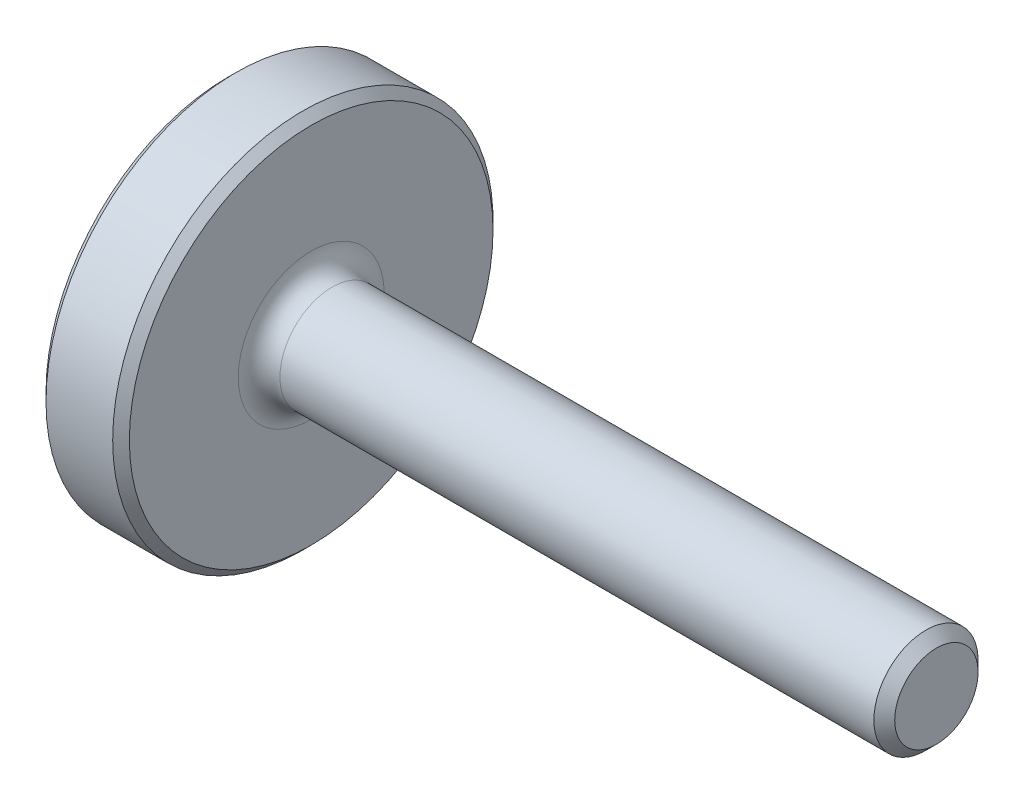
from build123d import *

# Parameters (mm, degrees)
FILLET2_R     = 2
SKETCH1_R     = 0.5
NOTHING_DEPTH = 2


with BuildPart() as part:
    # BodySke → Base-Revolve (revolve)
    with BuildSketch(Plane.XY, mode=Mode.PRIVATE) as base_revolve_sk:
        Polygon((67, 5), (68, 4), (68, 0), (0, 0), (0, 17.45), (0.8, 18.25), (7.2, 18.25), (8, 17.45), (8, 5), align=None)
    revolve(base_revolve_sk.sketch.rotate(Axis((-11.400788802, 0, 0), (1, 0, 0)), 90), axis=Axis((-11.400788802, 0, 0), (1, 0, 0)))

    # Fillet2
    fillet2_edges = [part.edges().sort_by_distance(p)[0] for p in [
        (8, 0, -5),
    ]]
    fillet(fillet2_edges, radius=FILLET2_R)

    # Sketch1 → Nothing (add)
    with BuildSketch(Plane(origin=(68, 0, 0), x_dir=(0, 0, -1), z_dir=(1, 0, 0))):
        Circle(SKETCH1_R)
    extrude(amount=-NOTHING_DEPTH)


solid = part.part
